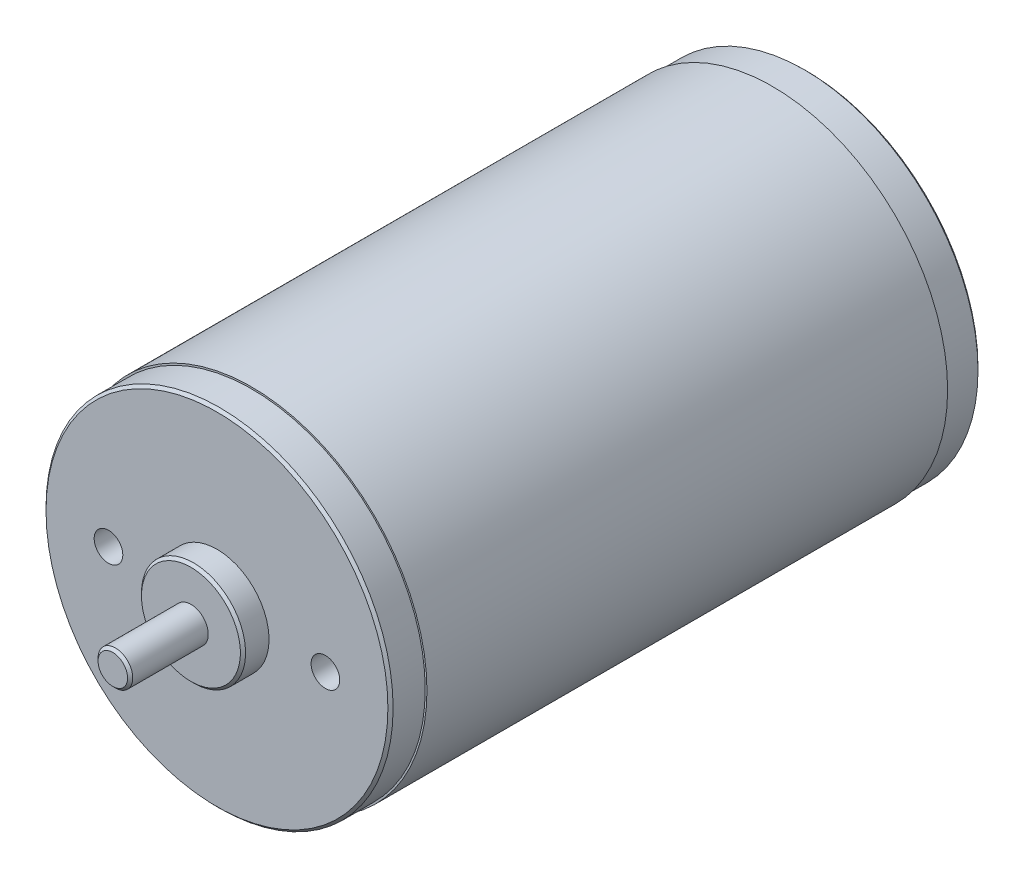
ISO-10303-21;
HEADER;
FILE_DESCRIPTION(('STEP AP214'),'2;1');
FILE_NAME('part.step','',(''),(''),'','','');
FILE_SCHEMA(('AUTOMOTIVE_DESIGN { 1 0 10303 214 1 1 1 1 }'));
ENDSEC;
DATA;
#1=APPLICATION_CONTEXT('core data for automotive mechanical design processes');
#2=APPLICATION_PROTOCOL_DEFINITION('international standard','automotive_design',2000,#1);
#3=PRODUCT_CONTEXT('',#1,'mechanical');
#4=PRODUCT('Part','Part','',(#3));
#5=PRODUCT_RELATED_PRODUCT_CATEGORY('part','',(#4));
#6=PRODUCT_DEFINITION_FORMATION('','',#4);
#7=PRODUCT_DEFINITION_CONTEXT('part definition',#1,'design');
#8=PRODUCT_DEFINITION('design','',#6,#7);
#9=PRODUCT_DEFINITION_SHAPE('','',#8);
#10=(LENGTH_UNIT() NAMED_UNIT(*) SI_UNIT(.MILLI.,.METRE.));
#11=(NAMED_UNIT(*) PLANE_ANGLE_UNIT() SI_UNIT($,.RADIAN.));
#12=(NAMED_UNIT(*) SI_UNIT($,.STERADIAN.) SOLID_ANGLE_UNIT());
#13=UNCERTAINTY_MEASURE_WITH_UNIT(LENGTH_MEASURE(1.E-05),#10,'distance_accuracy_value','');
#14=(GEOMETRIC_REPRESENTATION_CONTEXT(3) GLOBAL_UNCERTAINTY_ASSIGNED_CONTEXT((#13)) GLOBAL_UNIT_ASSIGNED_CONTEXT((#10,
#11,#12)) REPRESENTATION_CONTEXT('',''));
#15=CARTESIAN_POINT('',(0.,0.,0.));
#16=DIRECTION('',(0.,0.,1.));
#17=DIRECTION('',(1.,0.,0.));
#18=AXIS2_PLACEMENT_3D('',#15,#16,#17);
#19=CARTESIAN_POINT('',(0.,0.,12.));
#20=DIRECTION('',(0.,0.,1.));
#21=DIRECTION('',(1.,0.,0.));
#22=AXIS2_PLACEMENT_3D('',#19,#20,#21);
#23=PLANE('',#22);
#24=CARTESIAN_POINT('',(0.,0.,12.0000000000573));
#25=DIRECTION('',(0.,0.,-1.));
#26=DIRECTION('',(-1.,0.,0.));
#27=AXIS2_PLACEMENT_3D('',#24,#25,#26);
#28=CIRCLE('',#27,1.70000000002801);
#29=CARTESIAN_POINT('',(-1.70000000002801,0.,12.0000000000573));
#30=VERTEX_POINT('',#29);
#31=EDGE_CURVE('E20',#30,#30,#28,.T.);
#32=ORIENTED_EDGE('',*,*,#31,.F.);
#33=EDGE_LOOP('',(#32));
#34=FACE_BOUND('',#33,.T.);
#35=ADVANCED_FACE('F17',(#34),#23,.T.);
#36=CARTESIAN_POINT('',(0.,0.,11.7000000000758));
#37=DIRECTION('',(0.,0.,-1.));
#38=DIRECTION('',(-1.,0.,0.));
#39=AXIS2_PLACEMENT_3D('',#36,#37,#38);
#40=CONICAL_SURFACE('',#39,2.00000000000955,0.785398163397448);
#41=CARTESIAN_POINT('',(0.,0.,11.7));
#42=DIRECTION('',(0.,0.,-1.));
#43=DIRECTION('',(-1.,0.,0.));
#44=AXIS2_PLACEMENT_3D('',#41,#42,#43);
#45=CIRCLE('',#44,2.);
#46=CARTESIAN_POINT('',(-2.,0.,11.7));
#47=VERTEX_POINT('',#46);
#48=EDGE_CURVE('E53',#47,#47,#45,.T.);
#49=ORIENTED_EDGE('',*,*,#48,.F.);
#50=EDGE_LOOP('',(#49));
#51=FACE_BOUND('',#50,.T.);
#52=ORIENTED_EDGE('',*,*,#31,.T.);
#53=EDGE_LOOP('',(#52));
#54=FACE_BOUND('',#53,.T.);
#55=ADVANCED_FACE('F99',(#51,#54),#40,.T.);
#56=CARTESIAN_POINT('',(0.,0.,12.));
#57=DIRECTION('',(0.,0.,-1.));
#58=DIRECTION('',(-1.,0.,0.));
#59=AXIS2_PLACEMENT_3D('',#56,#57,#58);
#60=CYLINDRICAL_SURFACE('',#59,2.);
#61=CARTESIAN_POINT('',(0.,0.,3.));
#62=DIRECTION('',(0.,0.,-1.));
#63=DIRECTION('',(-1.,0.,0.));
#64=AXIS2_PLACEMENT_3D('',#61,#62,#63);
#65=CIRCLE('',#64,2.);
#66=CARTESIAN_POINT('',(-2.,0.,3.));
#67=VERTEX_POINT('',#66);
#68=EDGE_CURVE('E55',#67,#67,#65,.T.);
#69=ORIENTED_EDGE('',*,*,#68,.F.);
#70=EDGE_LOOP('',(#69));
#71=FACE_BOUND('',#70,.T.);
#72=ORIENTED_EDGE('',*,*,#48,.T.);
#73=EDGE_LOOP('',(#72));
#74=FACE_BOUND('',#73,.T.);
#75=ADVANCED_FACE('F95',(#71,#74),#60,.T.);
#76=CARTESIAN_POINT('',(0.,0.,-69.5));
#77=DIRECTION('',(0.,0.,-1.));
#78=DIRECTION('',(-1.,0.,0.));
#79=AXIS2_PLACEMENT_3D('',#76,#77,#78);
#80=PLANE('',#79);
#81=CARTESIAN_POINT('',(0.,0.,-69.5000000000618));
#82=DIRECTION('',(0.,0.,1.));
#83=DIRECTION('',(1.,0.,0.));
#84=AXIS2_PLACEMENT_3D('',#81,#82,#83);
#85=CIRCLE('',#84,6.02500000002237);
#86=CARTESIAN_POINT('',(6.02500000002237,0.,-69.5000000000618));
#87=VERTEX_POINT('',#86);
#88=EDGE_CURVE('E87',#87,#87,#85,.T.);
#89=ORIENTED_EDGE('',*,*,#88,.F.);
#90=EDGE_LOOP('',(#89));
#91=FACE_BOUND('',#90,.T.);
#92=ADVANCED_FACE('F98',(#91),#80,.T.);
#93=CARTESIAN_POINT('',(0.,0.,3.));
#94=DIRECTION('',(0.,0.,1.));
#95=DIRECTION('',(1.,0.,0.));
#96=AXIS2_PLACEMENT_3D('',#93,#94,#95);
#97=PLANE('',#96);
#98=ORIENTED_EDGE('',*,*,#68,.T.);
#99=EDGE_LOOP('',(#98));
#100=FACE_BOUND('',#99,.T.);
#101=CARTESIAN_POINT('',(0.,0.,2.9999999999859));
#102=DIRECTION('',(0.,0.,-1.));
#103=DIRECTION('',(-1.,0.,0.));
#104=AXIS2_PLACEMENT_3D('',#101,#102,#103);
#105=CIRCLE('',#104,5.70000000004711);
#106=CARTESIAN_POINT('',(-5.70000000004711,0.,2.9999999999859));
#107=VERTEX_POINT('',#106);
#108=EDGE_CURVE('E49',#107,#107,#105,.T.);
#109=ORIENTED_EDGE('',*,*,#108,.F.);
#110=EDGE_LOOP('',(#109));
#111=FACE_BOUND('',#110,.T.);
#112=ADVANCED_FACE('F92',(#100,#111),#97,.T.);
#113=CARTESIAN_POINT('',(0.,0.,-69.2000000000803));
#114=DIRECTION('',(0.,0.,1.));
#115=DIRECTION('',(1.,0.,0.));
#116=AXIS2_PLACEMENT_3D('',#113,#114,#115);
#117=CONICAL_SURFACE('',#116,6.32500000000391,0.785398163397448);
#118=ORIENTED_EDGE('',*,*,#88,.T.);
#119=EDGE_LOOP('',(#118));
#120=FACE_BOUND('',#119,.T.);
#121=CARTESIAN_POINT('',(0.,0.,-69.2));
#122=DIRECTION('',(0.,0.,1.));
#123=DIRECTION('',(1.,0.,0.));
#124=AXIS2_PLACEMENT_3D('',#121,#122,#123);
#125=CIRCLE('',#124,6.325);
#126=CARTESIAN_POINT('',(6.325,0.,-69.2));
#127=VERTEX_POINT('',#126);
#128=EDGE_CURVE('E43',#127,#127,#125,.T.);
#129=ORIENTED_EDGE('',*,*,#128,.F.);
#130=EDGE_LOOP('',(#129));
#131=FACE_BOUND('',#130,.T.);
#132=ADVANCED_FACE('F36',(#120,#131),#117,.T.);
#133=CARTESIAN_POINT('',(-12.5,0.,-8.10000000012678));
#134=DIRECTION('',(0.,0.,1.));
#135=DIRECTION('',(1.,0.,0.));
#136=AXIS2_PLACEMENT_3D('',#133,#134,#135);
#137=CONICAL_SURFACE('',#136,1.6499999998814,1.02974425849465);
#138=CARTESIAN_POINT('',(-12.5000000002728,0.,-9.09142002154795));
#139=VERTEX_POINT('',#138);
#140=VERTEX_LOOP('',#139);
#141=FACE_BOUND('',#140,.T.);
#142=CARTESIAN_POINT('',(-12.5,0.,-8.1));
#143=DIRECTION('',(0.,0.,1.));
#144=DIRECTION('',(1.,0.,0.));
#145=AXIS2_PLACEMENT_3D('',#142,#143,#144);
#146=CIRCLE('',#145,1.65);
#147=CARTESIAN_POINT('',(-10.85,0.,-8.1));
#148=VERTEX_POINT('',#147);
#149=EDGE_CURVE('E40',#148,#148,#146,.T.);
#150=ORIENTED_EDGE('',*,*,#149,.T.);
#151=EDGE_LOOP('',(#150));
#152=FACE_BOUND('',#151,.T.);
#153=ADVANCED_FACE('F32',(#141,#152),#137,.F.);
#154=CARTESIAN_POINT('',(12.5,0.,-8.10000000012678));
#155=DIRECTION('',(0.,0.,1.));
#156=DIRECTION('',(1.,0.,0.));
#157=AXIS2_PLACEMENT_3D('',#154,#155,#156);
#158=CONICAL_SURFACE('',#157,1.64999999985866,1.02974425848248);
#159=CARTESIAN_POINT('',(12.4999999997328,0.,-9.09142002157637));
#160=VERTEX_POINT('',#159);
#161=VERTEX_LOOP('',#160);
#162=FACE_BOUND('',#161,.T.);
#163=CARTESIAN_POINT('',(12.5,0.,-8.1));
#164=DIRECTION('',(0.,0.,1.));
#165=DIRECTION('',(1.,0.,0.));
#166=AXIS2_PLACEMENT_3D('',#163,#164,#165);
#167=CIRCLE('',#166,1.65);
#168=CARTESIAN_POINT('',(14.15,0.,-8.1));
#169=VERTEX_POINT('',#168);
#170=EDGE_CURVE('E42',#169,#169,#167,.T.);
#171=ORIENTED_EDGE('',*,*,#170,.T.);
#172=EDGE_LOOP('',(#171));
#173=FACE_BOUND('',#172,.T.);
#174=ADVANCED_FACE('F35',(#162,#173),#158,.F.);
#175=CARTESIAN_POINT('',(0.,0.,2.70000000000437));
#176=DIRECTION('',(0.,0.,-1.));
#177=DIRECTION('',(-1.,0.,0.));
#178=AXIS2_PLACEMENT_3D('',#175,#176,#177);
#179=CONICAL_SURFACE('',#178,6.00000000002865,0.785398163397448);
#180=CARTESIAN_POINT('',(0.,0.,2.70000000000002));
#181=DIRECTION('',(0.,0.,-1.));
#182=DIRECTION('',(-1.,0.,0.));
#183=AXIS2_PLACEMENT_3D('',#180,#181,#182);
#184=CIRCLE('',#183,6.);
#185=CARTESIAN_POINT('',(-6.,0.,2.70000000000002));
#186=VERTEX_POINT('',#185);
#187=EDGE_CURVE('E46',#186,#186,#184,.T.);
#188=ORIENTED_EDGE('',*,*,#187,.F.);
#189=EDGE_LOOP('',(#188));
#190=FACE_BOUND('',#189,.T.);
#191=ORIENTED_EDGE('',*,*,#108,.T.);
#192=EDGE_LOOP('',(#191));
#193=FACE_BOUND('',#192,.T.);
#194=ADVANCED_FACE('F167',(#190,#193),#179,.T.);
#195=CARTESIAN_POINT('',(0.,0.,-69.5));
#196=DIRECTION('',(0.,0.,1.));
#197=DIRECTION('',(1.,0.,0.));
#198=AXIS2_PLACEMENT_3D('',#195,#196,#197);
#199=CYLINDRICAL_SURFACE('',#198,6.325);
#200=ORIENTED_EDGE('',*,*,#128,.T.);
#201=EDGE_LOOP('',(#200));
#202=FACE_BOUND('',#201,.T.);
#203=CARTESIAN_POINT('',(0.,0.,-68.));
#204=DIRECTION('',(0.,0.,1.));
#205=DIRECTION('',(1.,0.,0.));
#206=AXIS2_PLACEMENT_3D('',#203,#204,#205);
#207=CIRCLE('',#206,6.325);
#208=CARTESIAN_POINT('',(6.325,0.,-68.));
#209=VERTEX_POINT('',#208);
#210=EDGE_CURVE('E82',#209,#209,#207,.F.);
#211=ORIENTED_EDGE('',*,*,#210,.T.);
#212=EDGE_LOOP('',(#211));
#213=FACE_BOUND('',#212,.T.);
#214=ADVANCED_FACE('F163',(#202,#213),#199,.T.);
#215=CARTESIAN_POINT('',(-12.5,0.,0.));
#216=DIRECTION('',(0.,0.,1.));
#217=DIRECTION('',(1.,0.,0.));
#218=AXIS2_PLACEMENT_3D('',#215,#216,#217);
#219=CYLINDRICAL_SURFACE('',#218,1.65);
#220=CARTESIAN_POINT('',(-12.5,0.,0.));
#221=DIRECTION('',(0.,0.,1.));
#222=DIRECTION('',(1.,0.,0.));
#223=AXIS2_PLACEMENT_3D('',#220,#221,#222);
#224=CIRCLE('',#223,1.65);
#225=CARTESIAN_POINT('',(-10.85,0.,0.));
#226=VERTEX_POINT('',#225);
#227=EDGE_CURVE('E79',#226,#226,#224,.F.);
#228=ORIENTED_EDGE('',*,*,#227,.F.);
#229=EDGE_LOOP('',(#228));
#230=FACE_BOUND('',#229,.T.);
#231=ORIENTED_EDGE('',*,*,#149,.F.);
#232=EDGE_LOOP('',(#231));
#233=FACE_BOUND('',#232,.T.);
#234=ADVANCED_FACE('F159',(#230,#233),#219,.F.);
#235=CARTESIAN_POINT('',(12.5,0.,0.));
#236=DIRECTION('',(0.,0.,1.));
#237=DIRECTION('',(1.,0.,0.));
#238=AXIS2_PLACEMENT_3D('',#235,#236,#237);
#239=CYLINDRICAL_SURFACE('',#238,1.65);
#240=CARTESIAN_POINT('',(12.5,0.,0.));
#241=DIRECTION('',(0.,0.,1.));
#242=DIRECTION('',(1.,0.,0.));
#243=AXIS2_PLACEMENT_3D('',#240,#241,#242);
#244=CIRCLE('',#243,1.65);
#245=CARTESIAN_POINT('',(14.15,0.,0.));
#246=VERTEX_POINT('',#245);
#247=EDGE_CURVE('E76',#246,#246,#244,.F.);
#248=ORIENTED_EDGE('',*,*,#247,.F.);
#249=EDGE_LOOP('',(#248));
#250=FACE_BOUND('',#249,.T.);
#251=ORIENTED_EDGE('',*,*,#170,.F.);
#252=EDGE_LOOP('',(#251));
#253=FACE_BOUND('',#252,.T.);
#254=ADVANCED_FACE('F155',(#250,#253),#239,.F.);
#255=CARTESIAN_POINT('',(0.,0.,3.));
#256=DIRECTION('',(0.,0.,-1.));
#257=DIRECTION('',(-1.,0.,0.));
#258=AXIS2_PLACEMENT_3D('',#255,#256,#257);
#259=CYLINDRICAL_SURFACE('',#258,6.);
#260=CARTESIAN_POINT('',(0.,0.,0.));
#261=DIRECTION('',(0.,0.,-1.));
#262=DIRECTION('',(-1.,0.,0.));
#263=AXIS2_PLACEMENT_3D('',#260,#261,#262);
#264=CIRCLE('',#263,6.);
#265=CARTESIAN_POINT('',(-6.,0.,0.));
#266=VERTEX_POINT('',#265);
#267=EDGE_CURVE('E73',#266,#266,#264,.T.);
#268=ORIENTED_EDGE('',*,*,#267,.F.);
#269=EDGE_LOOP('',(#268));
#270=FACE_BOUND('',#269,.T.);
#271=ORIENTED_EDGE('',*,*,#187,.T.);
#272=EDGE_LOOP('',(#271));
#273=FACE_BOUND('',#272,.T.);
#274=ADVANCED_FACE('F151',(#270,#273),#259,.T.);
#275=CARTESIAN_POINT('',(0.,0.,-68.));
#276=DIRECTION('',(0.,0.,1.));
#277=DIRECTION('',(1.,0.,0.));
#278=AXIS2_PLACEMENT_3D('',#275,#276,#277);
#279=PLANE('',#278);
#280=ORIENTED_EDGE('',*,*,#210,.F.);
#281=EDGE_LOOP('',(#280));
#282=FACE_BOUND('',#281,.T.);
#283=CARTESIAN_POINT('',(0.,0.,-68.));
#284=DIRECTION('',(0.,0.,1.));
#285=DIRECTION('',(1.,0.,0.));
#286=AXIS2_PLACEMENT_3D('',#283,#284,#285);
#287=CIRCLE('',#286,19.7);
#288=CARTESIAN_POINT('',(19.7,0.,-68.));
#289=VERTEX_POINT('',#288);
#290=EDGE_CURVE('E70',#289,#289,#287,.T.);
#291=ORIENTED_EDGE('',*,*,#290,.F.);
#292=EDGE_LOOP('',(#291));
#293=FACE_BOUND('',#292,.T.);
#294=ADVANCED_FACE('F147',(#282,#293),#279,.F.);
#295=CARTESIAN_POINT('',(0.,0.,0.));
#296=DIRECTION('',(0.,0.,1.));
#297=DIRECTION('',(1.,0.,0.));
#298=AXIS2_PLACEMENT_3D('',#295,#296,#297);
#299=PLANE('',#298);
#300=ORIENTED_EDGE('',*,*,#267,.T.);
#301=EDGE_LOOP('',(#300));
#302=FACE_BOUND('',#301,.T.);
#303=ORIENTED_EDGE('',*,*,#247,.T.);
#304=EDGE_LOOP('',(#303));
#305=FACE_BOUND('',#304,.T.);
#306=ORIENTED_EDGE('',*,*,#227,.T.);
#307=EDGE_LOOP('',(#306));
#308=FACE_BOUND('',#307,.T.);
#309=CARTESIAN_POINT('',(0.,0.,0.));
#310=DIRECTION('',(0.,0.,-1.));
#311=DIRECTION('',(-1.,0.,0.));
#312=AXIS2_PLACEMENT_3D('',#309,#310,#311);
#313=CIRCLE('',#312,19.7);
#314=CARTESIAN_POINT('',(-19.7,0.,0.));
#315=VERTEX_POINT('',#314);
#316=EDGE_CURVE('E66',#315,#315,#313,.T.);
#317=ORIENTED_EDGE('',*,*,#316,.F.);
#318=EDGE_LOOP('',(#317));
#319=FACE_BOUND('',#318,.T.);
#320=ADVANCED_FACE('F143',(#302,#305,#308,#319),#299,.T.);
#321=CARTESIAN_POINT('',(0.,0.,-67.7));
#322=DIRECTION('',(0.,0.,1.));
#323=DIRECTION('',(1.,0.,0.));
#324=AXIS2_PLACEMENT_3D('',#321,#322,#323);
#325=CONICAL_SURFACE('',#324,20.,0.785398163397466);
#326=ORIENTED_EDGE('',*,*,#290,.T.);
#327=EDGE_LOOP('',(#326));
#328=FACE_BOUND('',#327,.T.);
#329=CARTESIAN_POINT('',(0.,0.,-67.7));
#330=DIRECTION('',(0.,0.,-1.));
#331=DIRECTION('',(-1.,0.,0.));
#332=AXIS2_PLACEMENT_3D('',#329,#330,#331);
#333=CIRCLE('',#332,20.);
#334=CARTESIAN_POINT('',(-20.,0.,-67.7));
#335=VERTEX_POINT('',#334);
#336=EDGE_CURVE('E69',#335,#335,#333,.F.);
#337=ORIENTED_EDGE('',*,*,#336,.F.);
#338=EDGE_LOOP('',(#337));
#339=FACE_BOUND('',#338,.T.);
#340=ADVANCED_FACE('F139',(#328,#339),#325,.T.);
#341=CARTESIAN_POINT('',(0.,0.,-0.299999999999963));
#342=DIRECTION('',(0.,0.,-1.));
#343=DIRECTION('',(-1.,0.,0.));
#344=AXIS2_PLACEMENT_3D('',#341,#342,#343);
#345=CONICAL_SURFACE('',#344,20.,0.785398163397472);
#346=ORIENTED_EDGE('',*,*,#316,.T.);
#347=EDGE_LOOP('',(#346));
#348=FACE_BOUND('',#347,.T.);
#349=CARTESIAN_POINT('',(0.,0.,-0.299999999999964));
#350=DIRECTION('',(0.,0.,1.));
#351=DIRECTION('',(1.,0.,0.));
#352=AXIS2_PLACEMENT_3D('',#349,#350,#351);
#353=CIRCLE('',#352,20.);
#354=CARTESIAN_POINT('',(20.,0.,-0.299999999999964));
#355=VERTEX_POINT('',#354);
#356=EDGE_CURVE('E65',#355,#355,#353,.F.);
#357=ORIENTED_EDGE('',*,*,#356,.F.);
#358=EDGE_LOOP('',(#357));
#359=FACE_BOUND('',#358,.T.);
#360=ADVANCED_FACE('F135',(#348,#359),#345,.T.);
#361=CARTESIAN_POINT('',(0.,0.,-64.));
#362=DIRECTION('',(0.,0.,-1.));
#363=DIRECTION('',(-1.,0.,0.));
#364=AXIS2_PLACEMENT_3D('',#361,#362,#363);
#365=CYLINDRICAL_SURFACE('',#364,20.);
#366=CARTESIAN_POINT('',(0.,0.,-64.));
#367=DIRECTION('',(0.,0.,-1.));
#368=DIRECTION('',(-1.,0.,0.));
#369=AXIS2_PLACEMENT_3D('',#366,#367,#368);
#370=CIRCLE('',#369,20.);
#371=CARTESIAN_POINT('',(-20.,0.,-64.));
#372=VERTEX_POINT('',#371);
#373=EDGE_CURVE('E62',#372,#372,#370,.F.);
#374=ORIENTED_EDGE('',*,*,#373,.F.);
#375=EDGE_LOOP('',(#374));
#376=FACE_BOUND('',#375,.T.);
#377=ORIENTED_EDGE('',*,*,#336,.T.);
#378=EDGE_LOOP('',(#377));
#379=FACE_BOUND('',#378,.T.);
#380=ADVANCED_FACE('F131',(#376,#379),#365,.T.);
#381=CARTESIAN_POINT('',(0.,0.,-4.));
#382=DIRECTION('',(0.,0.,1.));
#383=DIRECTION('',(1.,0.,0.));
#384=AXIS2_PLACEMENT_3D('',#381,#382,#383);
#385=CYLINDRICAL_SURFACE('',#384,20.);
#386=CARTESIAN_POINT('',(0.,0.,-4.));
#387=DIRECTION('',(0.,0.,1.));
#388=DIRECTION('',(1.,0.,0.));
#389=AXIS2_PLACEMENT_3D('',#386,#387,#388);
#390=CIRCLE('',#389,20.);
#391=CARTESIAN_POINT('',(20.,0.,-4.));
#392=VERTEX_POINT('',#391);
#393=EDGE_CURVE('E59',#392,#392,#390,.F.);
#394=ORIENTED_EDGE('',*,*,#393,.F.);
#395=EDGE_LOOP('',(#394));
#396=FACE_BOUND('',#395,.T.);
#397=ORIENTED_EDGE('',*,*,#356,.T.);
#398=EDGE_LOOP('',(#397));
#399=FACE_BOUND('',#398,.T.);
#400=ADVANCED_FACE('F127',(#396,#399),#385,.T.);
#401=CARTESIAN_POINT('',(0.,0.,-64.));
#402=DIRECTION('',(0.,0.,-1.));
#403=DIRECTION('',(-1.,0.,0.));
#404=AXIS2_PLACEMENT_3D('',#401,#402,#403);
#405=PLANE('',#404);
#406=CARTESIAN_POINT('',(0.,0.,-64.));
#407=DIRECTION('',(0.,0.,1.));
#408=DIRECTION('',(1.,0.,0.));
#409=AXIS2_PLACEMENT_3D('',#406,#407,#408);
#410=CIRCLE('',#409,20.2);
#411=CARTESIAN_POINT('',(20.2,0.,-64.));
#412=VERTEX_POINT('',#411);
#413=EDGE_CURVE('E26',#412,#412,#410,.T.);
#414=ORIENTED_EDGE('',*,*,#413,.F.);
#415=EDGE_LOOP('',(#414));
#416=FACE_BOUND('',#415,.T.);
#417=ORIENTED_EDGE('',*,*,#373,.T.);
#418=EDGE_LOOP('',(#417));
#419=FACE_BOUND('',#418,.T.);
#420=ADVANCED_FACE('F120',(#416,#419),#405,.T.);
#421=CARTESIAN_POINT('',(0.,0.,-4.));
#422=DIRECTION('',(0.,0.,1.));
#423=DIRECTION('',(1.,0.,0.));
#424=AXIS2_PLACEMENT_3D('',#421,#422,#423);
#425=PLANE('',#424);
#426=CARTESIAN_POINT('',(0.,0.,-4.));
#427=DIRECTION('',(0.,0.,1.));
#428=DIRECTION('',(1.,0.,0.));
#429=AXIS2_PLACEMENT_3D('',#426,#427,#428);
#430=CIRCLE('',#429,20.2);
#431=CARTESIAN_POINT('',(20.2,0.,-4.));
#432=VERTEX_POINT('',#431);
#433=EDGE_CURVE('E11',#432,#432,#430,.F.);
#434=ORIENTED_EDGE('',*,*,#433,.F.);
#435=EDGE_LOOP('',(#434));
#436=FACE_BOUND('',#435,.T.);
#437=ORIENTED_EDGE('',*,*,#393,.T.);
#438=EDGE_LOOP('',(#437));
#439=FACE_BOUND('',#438,.T.);
#440=ADVANCED_FACE('F114',(#436,#439),#425,.T.);
#441=CARTESIAN_POINT('',(0.,0.,-68.));
#442=DIRECTION('',(0.,0.,1.));
#443=DIRECTION('',(1.,0.,0.));
#444=AXIS2_PLACEMENT_3D('',#441,#442,#443);
#445=CYLINDRICAL_SURFACE('',#444,20.2);
#446=ORIENTED_EDGE('',*,*,#433,.T.);
#447=EDGE_LOOP('',(#446));
#448=FACE_BOUND('',#447,.T.);
#449=ORIENTED_EDGE('',*,*,#413,.T.);
#450=EDGE_LOOP('',(#449));
#451=FACE_BOUND('',#450,.T.);
#452=ADVANCED_FACE('F112',(#448,#451),#445,.T.);
#453=CLOSED_SHELL('',(#35,#55,#75,#92,#112,#132,#153,#174,#194,#214,#234,#254,#274,#294,#320,
#340,#360,#380,#400,#420,#440,#452));
#454=MANIFOLD_SOLID_BREP('B1',#453);
#455=ADVANCED_BREP_SHAPE_REPRESENTATION('',(#18,#454),#14);
#456=SHAPE_DEFINITION_REPRESENTATION(#9,#455);
ENDSEC;
END-ISO-10303-21;
